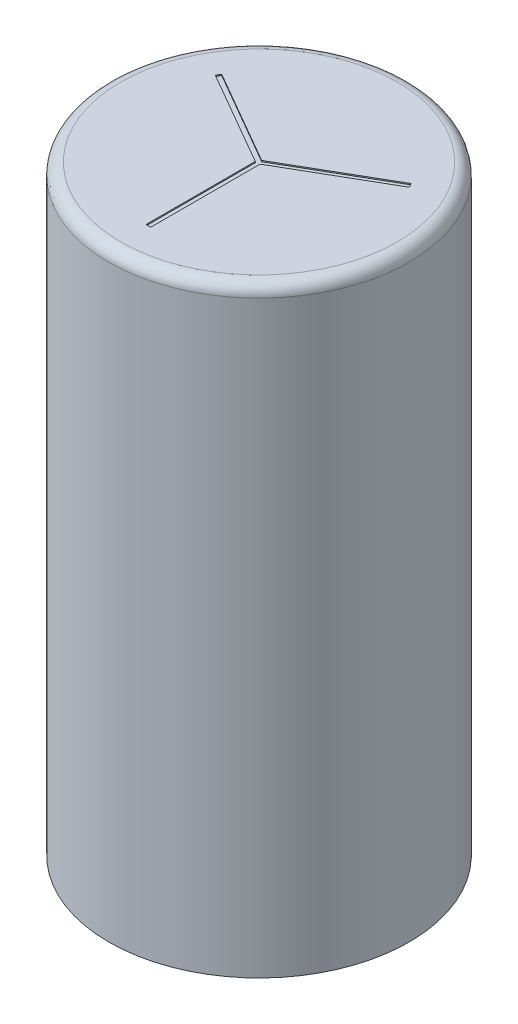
ISO-10303-21;
HEADER;
FILE_DESCRIPTION(('STEP AP214'),'2;1');
FILE_NAME('part.step','',(''),(''),'','','');
FILE_SCHEMA(('AUTOMOTIVE_DESIGN { 1 0 10303 214 1 1 1 1 }'));
ENDSEC;
DATA;
#1=APPLICATION_CONTEXT('core data for automotive mechanical design processes');
#2=APPLICATION_PROTOCOL_DEFINITION('international standard','automotive_design',2000,#1);
#3=PRODUCT_CONTEXT('',#1,'mechanical');
#4=PRODUCT('Part','Part','',(#3));
#5=PRODUCT_RELATED_PRODUCT_CATEGORY('part','',(#4));
#6=PRODUCT_DEFINITION_FORMATION('','',#4);
#7=PRODUCT_DEFINITION_CONTEXT('part definition',#1,'design');
#8=PRODUCT_DEFINITION('design','',#6,#7);
#9=PRODUCT_DEFINITION_SHAPE('','',#8);
#10=(LENGTH_UNIT() NAMED_UNIT(*) SI_UNIT(.MILLI.,.METRE.));
#11=(NAMED_UNIT(*) PLANE_ANGLE_UNIT() SI_UNIT($,.RADIAN.));
#12=(NAMED_UNIT(*) SI_UNIT($,.STERADIAN.) SOLID_ANGLE_UNIT());
#13=UNCERTAINTY_MEASURE_WITH_UNIT(LENGTH_MEASURE(1.E-05),#10,'distance_accuracy_value','');
#14=(GEOMETRIC_REPRESENTATION_CONTEXT(3) GLOBAL_UNCERTAINTY_ASSIGNED_CONTEXT((#13)) GLOBAL_UNIT_ASSIGNED_CONTEXT((#10,
#11,#12)) REPRESENTATION_CONTEXT('',''));
#15=CARTESIAN_POINT('',(0.,0.,0.));
#16=DIRECTION('',(0.,0.,1.));
#17=DIRECTION('',(1.,0.,0.));
#18=AXIS2_PLACEMENT_3D('',#15,#16,#17);
#19=CARTESIAN_POINT('',(0.,25.45,0.));
#20=DIRECTION('',(0.,1.,0.));
#21=DIRECTION('',(0.,0.,1.));
#22=AXIS2_PLACEMENT_3D('',#19,#20,#21);
#23=CYLINDRICAL_SURFACE('',#22,4.7);
#24=CARTESIAN_POINT('',(0.,25.45,0.));
#25=DIRECTION('',(0.,1.,0.));
#26=DIRECTION('',(0.,0.,1.));
#27=AXIS2_PLACEMENT_3D('',#24,#25,#26);
#28=CIRCLE('',#27,4.7);
#29=CARTESIAN_POINT('',(-0.1,25.45,4.69893604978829));
#30=VERTEX_POINT('',#29);
#31=CARTESIAN_POINT('',(0.100000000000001,25.45,4.69893604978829));
#32=VERTEX_POINT('',#31);
#33=EDGE_CURVE('E130',#30,#32,#28,.T.);
#34=ORIENTED_EDGE('',*,*,#33,.F.);
#35=DIRECTION('',(0.,1.,0.));
#36=VECTOR('',#35,1.);
#37=CARTESIAN_POINT('',(-0.1,25.45,4.69893604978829));
#38=LINE('',#37,#36);
#39=CARTESIAN_POINT('',(-0.1,25.5,4.69893604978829));
#40=VERTEX_POINT('',#39);
#41=EDGE_CURVE('E131',#30,#40,#38,.T.);
#42=ORIENTED_EDGE('',*,*,#41,.T.);
#43=CARTESIAN_POINT('',(0.,25.5,0.));
#44=DIRECTION('',(0.,1.,0.));
#45=DIRECTION('',(0.,0.,1.));
#46=AXIS2_PLACEMENT_3D('',#43,#44,#45);
#47=CIRCLE('',#46,4.7);
#48=CARTESIAN_POINT('',(0.100000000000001,25.5,4.69893604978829));
#49=VERTEX_POINT('',#48);
#50=EDGE_CURVE('E11',#40,#49,#47,.T.);
#51=ORIENTED_EDGE('',*,*,#50,.T.);
#52=DIRECTION('',(0.,1.,0.));
#53=VECTOR('',#52,1.);
#54=CARTESIAN_POINT('',(0.100000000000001,25.45,4.69893604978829));
#55=LINE('',#54,#53);
#56=EDGE_CURVE('E36',#32,#49,#55,.T.);
#57=ORIENTED_EDGE('',*,*,#56,.F.);
#58=EDGE_LOOP('',(#34,#42,#51,#57));
#59=FACE_BOUND('',#58,.T.);
#60=ADVANCED_FACE('F17',(#59),#23,.F.);
#61=CARTESIAN_POINT('',(0.,25.,0.));
#62=DIRECTION('',(0.,1.,0.));
#63=DIRECTION('',(0.,0.,1.));
#64=AXIS2_PLACEMENT_3D('',#61,#62,#63);
#65=TOROIDAL_SURFACE('',#64,5.875,0.5);
#66=CARTESIAN_POINT('',(0.,25.5,0.));
#67=DIRECTION('',(0.,1.,0.));
#68=DIRECTION('',(0.,0.,1.));
#69=AXIS2_PLACEMENT_3D('',#66,#67,#68);
#70=CIRCLE('',#69,5.875);
#71=CARTESIAN_POINT('',(0.,25.5,5.875));
#72=VERTEX_POINT('',#71);
#73=EDGE_CURVE('E155',#72,#72,#70,.T.);
#74=ORIENTED_EDGE('',*,*,#73,.F.);
#75=EDGE_LOOP('',(#74));
#76=FACE_BOUND('',#75,.T.);
#77=CARTESIAN_POINT('',(0.,25.,0.));
#78=DIRECTION('',(0.,-1.,0.));
#79=DIRECTION('',(0.,0.,1.));
#80=AXIS2_PLACEMENT_3D('',#77,#78,#79);
#81=CIRCLE('',#80,6.375);
#82=CARTESIAN_POINT('',(0.,25.,6.375));
#83=VERTEX_POINT('',#82);
#84=EDGE_CURVE('E27',#83,#83,#81,.T.);
#85=ORIENTED_EDGE('',*,*,#84,.F.);
#86=EDGE_LOOP('',(#85));
#87=FACE_BOUND('',#86,.T.);
#88=ADVANCED_FACE('F202',(#76,#87),#65,.T.);
#89=CARTESIAN_POINT('',(0.,25.5,0.));
#90=DIRECTION('',(0.,-1.,0.));
#91=DIRECTION('',(0.,0.,-1.));
#92=AXIS2_PLACEMENT_3D('',#89,#90,#91);
#93=CYLINDRICAL_SURFACE('',#92,6.375);
#94=CARTESIAN_POINT('',(0.,0.,0.));
#95=DIRECTION('',(0.,1.,0.));
#96=DIRECTION('',(0.,0.,1.));
#97=AXIS2_PLACEMENT_3D('',#94,#95,#96);
#98=CIRCLE('',#97,6.375);
#99=CARTESIAN_POINT('',(0.,0.,6.375));
#100=VERTEX_POINT('',#99);
#101=EDGE_CURVE('E162',#100,#100,#98,.T.);
#102=ORIENTED_EDGE('',*,*,#101,.T.);
#103=EDGE_LOOP('',(#102));
#104=FACE_BOUND('',#103,.T.);
#105=ORIENTED_EDGE('',*,*,#84,.T.);
#106=EDGE_LOOP('',(#105));
#107=FACE_BOUND('',#106,.T.);
#108=ADVANCED_FACE('F207',(#104,#107),#93,.T.);
#109=CARTESIAN_POINT('',(0.,25.5,0.));
#110=DIRECTION('',(0.,1.,0.));
#111=DIRECTION('',(0.,0.,1.));
#112=AXIS2_PLACEMENT_3D('',#109,#110,#111);
#113=PLANE('',#112);
#114=DIRECTION('',(0.86602540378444,0.,-0.499999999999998));
#115=VECTOR('',#114,1.);
#116=CARTESIAN_POINT('',(0.1,25.5,0.0577350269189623));
#117=LINE('',#116,#115);
#118=CARTESIAN_POINT('',(0.1,25.5,0.0577350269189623));
#119=VERTEX_POINT('',#118);
#120=CARTESIAN_POINT('',(4.11939798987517,25.5,-2.26286548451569));
#121=VERTEX_POINT('',#120);
#122=EDGE_CURVE('E120',#119,#121,#117,.T.);
#123=ORIENTED_EDGE('',*,*,#122,.F.);
#124=DIRECTION('',(0.,0.,-1.));
#125=VECTOR('',#124,1.);
#126=CARTESIAN_POINT('',(0.1,25.5,4.69893604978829));
#127=LINE('',#126,#125);
#128=EDGE_CURVE('E127',#49,#119,#127,.T.);
#129=ORIENTED_EDGE('',*,*,#128,.F.);
#130=ORIENTED_EDGE('',*,*,#50,.F.);
#131=DIRECTION('',(0.,0.,1.));
#132=VECTOR('',#131,1.);
#133=CARTESIAN_POINT('',(-0.1,25.5,4.69893604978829));
#134=LINE('',#133,#132);
#135=CARTESIAN_POINT('',(-0.0999999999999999,25.5,0.0577350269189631));
#136=VERTEX_POINT('',#135);
#137=EDGE_CURVE('E134',#136,#40,#134,.T.);
#138=ORIENTED_EDGE('',*,*,#137,.F.);
#139=DIRECTION('',(0.86602540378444,0.,0.499999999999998));
#140=VECTOR('',#139,1.);
#141=CARTESIAN_POINT('',(-0.0999999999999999,25.5,0.0577350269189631));
#142=LINE('',#141,#140);
#143=CARTESIAN_POINT('',(-4.11939798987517,25.5,-2.26286548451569));
#144=VERTEX_POINT('',#143);
#145=EDGE_CURVE('E142',#144,#136,#142,.T.);
#146=ORIENTED_EDGE('',*,*,#145,.F.);
#147=CARTESIAN_POINT('',(0.,25.5,0.));
#148=DIRECTION('',(0.,1.,0.));
#149=DIRECTION('',(0.,0.,1.));
#150=AXIS2_PLACEMENT_3D('',#147,#148,#149);
#151=CIRCLE('',#150,4.7);
#152=CARTESIAN_POINT('',(-4.01939798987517,25.5,-2.43607056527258));
#153=VERTEX_POINT('',#152);
#154=EDGE_CURVE('E148',#153,#144,#151,.T.);
#155=ORIENTED_EDGE('',*,*,#154,.F.);
#156=DIRECTION('',(-0.86602540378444,0.,-0.499999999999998));
#157=VECTOR('',#156,1.);
#158=CARTESIAN_POINT('',(0.,25.5,-0.115470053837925));
#159=LINE('',#158,#157);
#160=CARTESIAN_POINT('',(0.,25.5,-0.115470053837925));
#161=VERTEX_POINT('',#160);
#162=EDGE_CURVE('E107',#161,#153,#159,.T.);
#163=ORIENTED_EDGE('',*,*,#162,.F.);
#164=DIRECTION('',(-0.86602540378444,0.,0.499999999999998));
#165=VECTOR('',#164,1.);
#166=CARTESIAN_POINT('',(0.,25.5,-0.115470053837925));
#167=LINE('',#166,#165);
#168=CARTESIAN_POINT('',(4.01939798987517,25.5,-2.43607056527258));
#169=VERTEX_POINT('',#168);
#170=EDGE_CURVE('E105',#169,#161,#167,.T.);
#171=ORIENTED_EDGE('',*,*,#170,.F.);
#172=CARTESIAN_POINT('',(0.,25.5,0.));
#173=DIRECTION('',(0.,1.,0.));
#174=DIRECTION('',(0.,0.,1.));
#175=AXIS2_PLACEMENT_3D('',#172,#173,#174);
#176=CIRCLE('',#175,4.7);
#177=EDGE_CURVE('E119',#121,#169,#176,.T.);
#178=ORIENTED_EDGE('',*,*,#177,.F.);
#179=EDGE_LOOP('',(#123,#129,#130,#138,#146,#155,#163,#171,#178));
#180=FACE_BOUND('',#179,.T.);
#181=ORIENTED_EDGE('',*,*,#73,.T.);
#182=EDGE_LOOP('',(#181));
#183=FACE_BOUND('',#182,.T.);
#184=ADVANCED_FACE('F182',(#180,#183),#113,.T.);
#185=CARTESIAN_POINT('',(0.,0.,0.));
#186=DIRECTION('',(0.,1.,0.));
#187=DIRECTION('',(0.,0.,1.));
#188=AXIS2_PLACEMENT_3D('',#185,#186,#187);
#189=PLANE('',#188);
#190=ORIENTED_EDGE('',*,*,#101,.F.);
#191=EDGE_LOOP('',(#190));
#192=FACE_BOUND('',#191,.T.);
#193=ADVANCED_FACE('F216',(#192),#189,.F.);
#194=CARTESIAN_POINT('',(0.,25.45,0.));
#195=DIRECTION('',(0.,1.,0.));
#196=DIRECTION('',(0.,0.,1.));
#197=AXIS2_PLACEMENT_3D('',#194,#195,#196);
#198=CYLINDRICAL_SURFACE('',#197,4.7);
#199=ORIENTED_EDGE('',*,*,#177,.T.);
#200=DIRECTION('',(0.,1.,0.));
#201=VECTOR('',#200,1.);
#202=CARTESIAN_POINT('',(4.01939798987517,25.45,-2.43607056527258));
#203=LINE('',#202,#201);
#204=CARTESIAN_POINT('',(4.01939798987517,25.45,-2.43607056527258));
#205=VERTEX_POINT('',#204);
#206=EDGE_CURVE('E111',#205,#169,#203,.T.);
#207=ORIENTED_EDGE('',*,*,#206,.F.);
#208=CARTESIAN_POINT('',(0.,25.45,0.));
#209=DIRECTION('',(0.,1.,0.));
#210=DIRECTION('',(0.,0.,1.));
#211=AXIS2_PLACEMENT_3D('',#208,#209,#210);
#212=CIRCLE('',#211,4.7);
#213=CARTESIAN_POINT('',(4.11939798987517,25.45,-2.26286548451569));
#214=VERTEX_POINT('',#213);
#215=EDGE_CURVE('E109',#214,#205,#212,.T.);
#216=ORIENTED_EDGE('',*,*,#215,.F.);
#217=DIRECTION('',(0.,1.,0.));
#218=VECTOR('',#217,1.);
#219=CARTESIAN_POINT('',(4.11939798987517,25.45,-2.26286548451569));
#220=LINE('',#219,#218);
#221=EDGE_CURVE('E116',#214,#121,#220,.T.);
#222=ORIENTED_EDGE('',*,*,#221,.T.);
#223=EDGE_LOOP('',(#199,#207,#216,#222));
#224=FACE_BOUND('',#223,.T.);
#225=ADVANCED_FACE('F180',(#224),#198,.F.);
#226=CARTESIAN_POINT('',(0.1,25.45,0.0577350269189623));
#227=DIRECTION('',(0.499999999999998,0.,0.86602540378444));
#228=DIRECTION('',(0.86602540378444,0.,-0.499999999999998));
#229=AXIS2_PLACEMENT_3D('',#226,#227,#228);
#230=PLANE('',#229);
#231=ORIENTED_EDGE('',*,*,#122,.T.);
#232=ORIENTED_EDGE('',*,*,#221,.F.);
#233=DIRECTION('',(0.86602540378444,0.,-0.499999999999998));
#234=VECTOR('',#233,1.);
#235=CARTESIAN_POINT('',(0.1,25.45,0.0577350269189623));
#236=LINE('',#235,#234);
#237=CARTESIAN_POINT('',(0.1,25.45,0.0577350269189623));
#238=VERTEX_POINT('',#237);
#239=EDGE_CURVE('E121',#238,#214,#236,.T.);
#240=ORIENTED_EDGE('',*,*,#239,.F.);
#241=DIRECTION('',(0.,1.,0.));
#242=VECTOR('',#241,1.);
#243=CARTESIAN_POINT('',(0.1,25.45,0.0577350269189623));
#244=LINE('',#243,#242);
#245=EDGE_CURVE('E124',#238,#119,#244,.T.);
#246=ORIENTED_EDGE('',*,*,#245,.T.);
#247=EDGE_LOOP('',(#231,#232,#240,#246));
#248=FACE_BOUND('',#247,.T.);
#249=ADVANCED_FACE('F176',(#248),#230,.F.);
#250=CARTESIAN_POINT('',(0.1,25.45,4.69893604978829));
#251=DIRECTION('',(1.,0.,0.));
#252=DIRECTION('',(0.,0.,-1.));
#253=AXIS2_PLACEMENT_3D('',#250,#251,#252);
#254=PLANE('',#253);
#255=ORIENTED_EDGE('',*,*,#128,.T.);
#256=ORIENTED_EDGE('',*,*,#245,.F.);
#257=DIRECTION('',(0.,0.,-1.));
#258=VECTOR('',#257,1.);
#259=CARTESIAN_POINT('',(0.1,25.45,4.69893604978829));
#260=LINE('',#259,#258);
#261=EDGE_CURVE('E123',#32,#238,#260,.T.);
#262=ORIENTED_EDGE('',*,*,#261,.F.);
#263=ORIENTED_EDGE('',*,*,#56,.T.);
#264=EDGE_LOOP('',(#255,#256,#262,#263));
#265=FACE_BOUND('',#264,.T.);
#266=ADVANCED_FACE('F173',(#265),#254,.F.);
#267=CARTESIAN_POINT('',(-0.1,25.45,4.69893604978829));
#268=DIRECTION('',(-1.,0.,0.));
#269=DIRECTION('',(0.,0.,1.));
#270=AXIS2_PLACEMENT_3D('',#267,#268,#269);
#271=PLANE('',#270);
#272=ORIENTED_EDGE('',*,*,#137,.T.);
#273=ORIENTED_EDGE('',*,*,#41,.F.);
#274=DIRECTION('',(0.,0.,1.));
#275=VECTOR('',#274,1.);
#276=CARTESIAN_POINT('',(-0.1,25.45,4.69893604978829));
#277=LINE('',#276,#275);
#278=CARTESIAN_POINT('',(-0.0999999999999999,25.45,0.0577350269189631));
#279=VERTEX_POINT('',#278);
#280=EDGE_CURVE('E135',#279,#30,#277,.T.);
#281=ORIENTED_EDGE('',*,*,#280,.F.);
#282=DIRECTION('',(0.,1.,0.));
#283=VECTOR('',#282,1.);
#284=CARTESIAN_POINT('',(-0.0999999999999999,25.45,0.0577350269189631));
#285=LINE('',#284,#283);
#286=EDGE_CURVE('E139',#279,#136,#285,.T.);
#287=ORIENTED_EDGE('',*,*,#286,.T.);
#288=EDGE_LOOP('',(#272,#273,#281,#287));
#289=FACE_BOUND('',#288,.T.);
#290=ADVANCED_FACE('F191',(#289),#271,.F.);
#291=CARTESIAN_POINT('',(-0.0999999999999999,25.45,0.0577350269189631));
#292=DIRECTION('',(-0.499999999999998,0.,0.86602540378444));
#293=DIRECTION('',(0.86602540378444,0.,0.499999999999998));
#294=AXIS2_PLACEMENT_3D('',#291,#292,#293);
#295=PLANE('',#294);
#296=ORIENTED_EDGE('',*,*,#145,.T.);
#297=ORIENTED_EDGE('',*,*,#286,.F.);
#298=DIRECTION('',(0.86602540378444,0.,0.499999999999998));
#299=VECTOR('',#298,1.);
#300=CARTESIAN_POINT('',(-0.0999999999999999,25.45,0.0577350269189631));
#301=LINE('',#300,#299);
#302=CARTESIAN_POINT('',(-4.11939798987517,25.45,-2.26286548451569));
#303=VERTEX_POINT('',#302);
#304=EDGE_CURVE('E138',#303,#279,#301,.T.);
#305=ORIENTED_EDGE('',*,*,#304,.F.);
#306=DIRECTION('',(0.,1.,0.));
#307=VECTOR('',#306,1.);
#308=CARTESIAN_POINT('',(-4.11939798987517,25.45,-2.26286548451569));
#309=LINE('',#308,#307);
#310=EDGE_CURVE('E145',#303,#144,#309,.T.);
#311=ORIENTED_EDGE('',*,*,#310,.T.);
#312=EDGE_LOOP('',(#296,#297,#305,#311));
#313=FACE_BOUND('',#312,.T.);
#314=ADVANCED_FACE('F189',(#313),#295,.F.);
#315=CARTESIAN_POINT('',(0.,25.45,0.));
#316=DIRECTION('',(0.,1.,0.));
#317=DIRECTION('',(0.,0.,1.));
#318=AXIS2_PLACEMENT_3D('',#315,#316,#317);
#319=CYLINDRICAL_SURFACE('',#318,4.7);
#320=ORIENTED_EDGE('',*,*,#154,.T.);
#321=ORIENTED_EDGE('',*,*,#310,.F.);
#322=CARTESIAN_POINT('',(0.,25.45,0.));
#323=DIRECTION('',(0.,1.,0.));
#324=DIRECTION('',(0.,0.,1.));
#325=AXIS2_PLACEMENT_3D('',#322,#323,#324);
#326=CIRCLE('',#325,4.7);
#327=CARTESIAN_POINT('',(-4.01939798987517,25.45,-2.43607056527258));
#328=VERTEX_POINT('',#327);
#329=EDGE_CURVE('E87',#328,#303,#326,.T.);
#330=ORIENTED_EDGE('',*,*,#329,.F.);
#331=DIRECTION('',(0.,1.,0.));
#332=VECTOR('',#331,1.);
#333=CARTESIAN_POINT('',(-4.01939798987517,25.45,-2.43607056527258));
#334=LINE('',#333,#332);
#335=EDGE_CURVE('E97',#328,#153,#334,.T.);
#336=ORIENTED_EDGE('',*,*,#335,.T.);
#337=EDGE_LOOP('',(#320,#321,#330,#336));
#338=FACE_BOUND('',#337,.T.);
#339=ADVANCED_FACE('F186',(#338),#319,.F.);
#340=CARTESIAN_POINT('',(0.,25.45,-0.115470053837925));
#341=DIRECTION('',(0.499999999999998,0.,-0.86602540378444));
#342=DIRECTION('',(-0.86602540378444,0.,-0.499999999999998));
#343=AXIS2_PLACEMENT_3D('',#340,#341,#342);
#344=PLANE('',#343);
#345=ORIENTED_EDGE('',*,*,#162,.T.);
#346=ORIENTED_EDGE('',*,*,#335,.F.);
#347=DIRECTION('',(-0.86602540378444,0.,-0.499999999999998));
#348=VECTOR('',#347,1.);
#349=CARTESIAN_POINT('',(0.,25.45,-0.115470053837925));
#350=LINE('',#349,#348);
#351=CARTESIAN_POINT('',(0.,25.45,-0.115470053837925));
#352=VERTEX_POINT('',#351);
#353=EDGE_CURVE('E93',#352,#328,#350,.T.);
#354=ORIENTED_EDGE('',*,*,#353,.F.);
#355=DIRECTION('',(0.,1.,0.));
#356=VECTOR('',#355,1.);
#357=CARTESIAN_POINT('',(0.,25.45,-0.115470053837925));
#358=LINE('',#357,#356);
#359=EDGE_CURVE('E96',#352,#161,#358,.T.);
#360=ORIENTED_EDGE('',*,*,#359,.T.);
#361=EDGE_LOOP('',(#345,#346,#354,#360));
#362=FACE_BOUND('',#361,.T.);
#363=ADVANCED_FACE('F95',(#362),#344,.F.);
#364=CARTESIAN_POINT('',(0.,25.45,-0.115470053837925));
#365=DIRECTION('',(-0.499999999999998,0.,-0.86602540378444));
#366=DIRECTION('',(-0.86602540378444,0.,0.499999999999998));
#367=AXIS2_PLACEMENT_3D('',#364,#365,#366);
#368=PLANE('',#367);
#369=ORIENTED_EDGE('',*,*,#170,.T.);
#370=ORIENTED_EDGE('',*,*,#359,.F.);
#371=DIRECTION('',(-0.86602540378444,0.,0.499999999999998));
#372=VECTOR('',#371,1.);
#373=CARTESIAN_POINT('',(0.,25.45,-0.115470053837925));
#374=LINE('',#373,#372);
#375=EDGE_CURVE('E21',#205,#352,#374,.T.);
#376=ORIENTED_EDGE('',*,*,#375,.F.);
#377=ORIENTED_EDGE('',*,*,#206,.T.);
#378=EDGE_LOOP('',(#369,#370,#376,#377));
#379=FACE_BOUND('',#378,.T.);
#380=ADVANCED_FACE('F103',(#379),#368,.F.);
#381=CARTESIAN_POINT('',(0.,25.45,0.));
#382=DIRECTION('',(0.,1.,0.));
#383=DIRECTION('',(0.,0.,1.));
#384=AXIS2_PLACEMENT_3D('',#381,#382,#383);
#385=PLANE('',#384);
#386=ORIENTED_EDGE('',*,*,#215,.T.);
#387=ORIENTED_EDGE('',*,*,#375,.T.);
#388=ORIENTED_EDGE('',*,*,#353,.T.);
#389=ORIENTED_EDGE('',*,*,#329,.T.);
#390=ORIENTED_EDGE('',*,*,#304,.T.);
#391=ORIENTED_EDGE('',*,*,#280,.T.);
#392=ORIENTED_EDGE('',*,*,#33,.T.);
#393=ORIENTED_EDGE('',*,*,#261,.T.);
#394=ORIENTED_EDGE('',*,*,#239,.T.);
#395=EDGE_LOOP('',(#386,#387,#388,#389,#390,#391,#392,#393,#394));
#396=FACE_BOUND('',#395,.T.);
#397=ADVANCED_FACE('F19',(#396),#385,.T.);
#398=CLOSED_SHELL('',(#60,#88,#108,#184,#193,#225,#249,#266,#290,#314,#339,#363,#380,#397));
#399=MANIFOLD_SOLID_BREP('B1',#398);
#400=ADVANCED_BREP_SHAPE_REPRESENTATION('',(#18,#399),#14);
#401=SHAPE_DEFINITION_REPRESENTATION(#9,#400);
ENDSEC;
END-ISO-10303-21;
